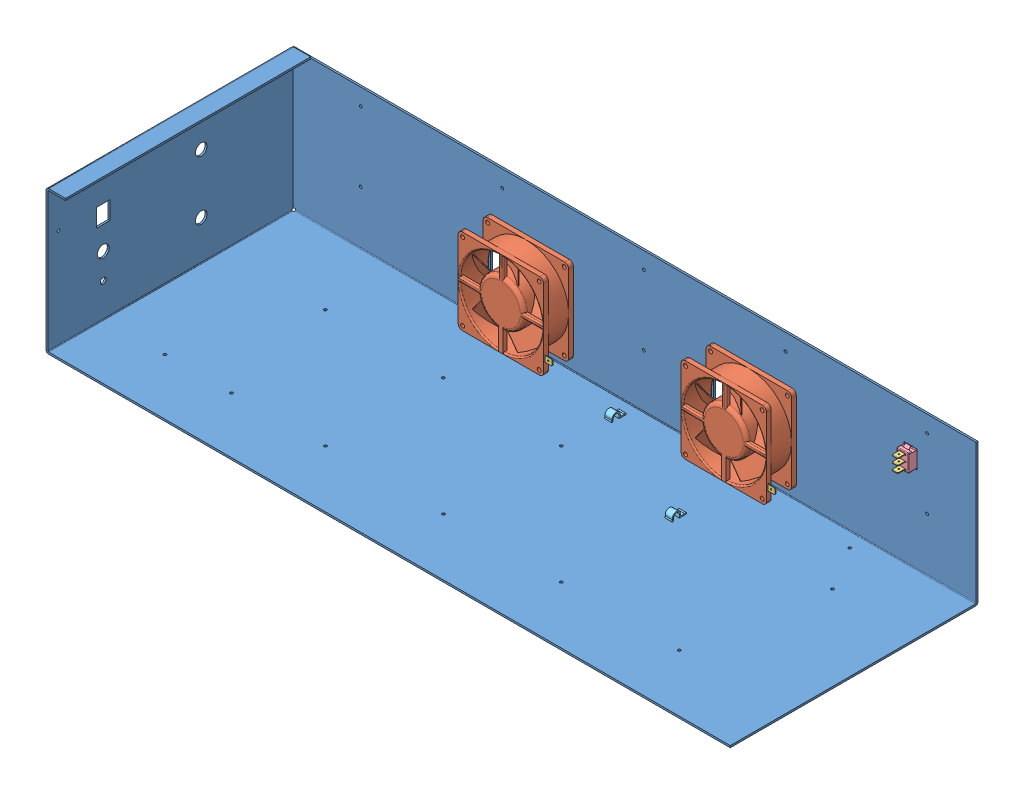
SolidWorks assembly Using_Slide_Clips.SLDASM, configuration Default (file format 13000). Lengths in mm.
Overall size (736.6 157.1 273.21).
14 component instances, 5 part files, 13 mates.
Components (placement in the parent):
- generic_enclosure-1: generic_enclosure.SLDPRT [Default] at origin size (736.6 154.43 266.72)
- FAN-1: FAN.SLDASM [Default] at (174.512 -3.3891 -442.2279) size (105.02 92.14 32.23)
  - FAN_w_CONN-1: FAN_w_CONN.SLDPRT [Default] at (-298.512 61.4211 233.7599) size (97.22 92.14 32.23)
  - Slide_Clip_Male-1: Slide_Clip_Male.SLDPRT [Default] at (-249.112 31.9883 237.1425) x (0 1 0) z (1 0 0) size (7.92 0.81 14.02)
- FAN-2: FAN.SLDASM [Default] at (414.512 -3.3891 -442.2279) size (105.02 92.14 32.23)
  - FAN_w_CONN-1: FAN_w_CONN.SLDPRT [Default] at (-298.512 61.4211 233.7599) size (97.22 92.14 32.23)
  - Slide_Clip_Male-1: Slide_Clip_Male.SLDPRT [Default] at (-249.112 31.9883 237.1425) x (0 1 0) z (1 0 0) size (7.92 0.81 14.02)
- SWITCH-2: SWITCH.SLDASM [Default] at (280.797 105.2322 -239.532) x (-1 0 0) z (0 0 -1) size (15.01 23.42 25.66)
  - SWITCH-3 PRONGS-1: SWITCH-3 PRONGS.SLDPRT [Default] at origin size (15.01 23.42 17.74)
  - Slide_Clip_Male-1: Slide_Clip_Male.SLDPRT [Default] at (-4.318 -6.556 -16.6842) x (-1 0 0) z (0 0 -1) size (7.92 0.81 14.02)
  - Slide_Clip_Male-2: Slide_Clip_Male.SLDPRT [Default] at (-4.318 0.4544 -16.6842) x (-1 0 0) z (0 0 -1) size (7.92 0.81 14.02)
  - Slide_Clip_Male-4: Slide_Clip_Male.SLDPRT [Default] at (-4.318 7.2108 -16.6842) x (-1 0 0) z (0 0 -1) size (7.92 0.81 14.02)
- richco_hurc-4-01-clip_3-3: richco_hurc-4-01-clip_3.SLDPRT [Default] at (112.268 5.207 -152.41) x (0 0 1) z (-1 0 0) size (15.75 12.32 7.64)
- richco_hurc-4-01-clip_3-5: richco_hurc-4-01-clip_3.SLDPRT [Default] at (-12.8623 5.207 -212.6259) x (0 0 1) z (-1 0 0) size (15.75 12.32 7.64)
Mates (geometry in assembly coordinates):
- Coincident1: coincident: plane of generic_enclosure-1 through (-381 152.4 -235.468) normal (0 0 1); plane of FAN-1/FAN_w_CONN-1 through (-170 104.032 -235.468) normal (0 0 -1)
- Concentric1: concentric: cylinder of generic_enclosure-1 through (-82.75 16.782 -237.5) axis (0 0 1) radius 2.15; cylinder of FAN-1/FAN_w_CONN-1 through (-82.75 16.782 -203.468) axis (0 0 -1) radius 2.15
- Concentric2: concentric: cylinder of generic_enclosure-1 through (-82.75 99.282 -237.5) axis (0 0 1) radius 2.15; cylinder of FAN-1/FAN_w_CONN-1 through (-82.75 99.282 -203.468) axis (0 0 -1) radius 2.15
- Coincident6: coincident: plane of generic_enclosure-1 through (-381 152.4 -235.468) normal (0 0 1); plane of FAN-2/FAN_w_CONN-1 through (70 104.032 -235.468) normal (0 0 -1)
- Concentric3: concentric: cylinder of generic_enclosure-1 through (157.25 16.782 -237.5) axis (0 0 1) radius 2.15; cylinder of FAN-2/FAN_w_CONN-1 through (157.25 16.782 -203.468) axis (0 0 -1) radius 2.15
- Concentric4: concentric: cylinder of generic_enclosure-1 through (157.25 99.282 -237.5) axis (0 0 1) radius 2.15; cylinder of FAN-2/FAN_w_CONN-1 through (157.25 99.282 -203.468) axis (0 0 -1) radius 2.15
- Coincident112: coincident: plane of generic_enclosure-1 through (-381 152.4 -237.5) normal (0 0 -1); plane of SWITCH-2/SWITCH-3 PRONGS-1 through (293.2557 94.8182 -237.5) normal (0 0 1)
- Coincident113: coincident: plane of generic_enclosure-1 through (277.876 114.3 -237.5) normal (0 -1 0); plane of SWITCH-2/SWITCH-3 PRONGS-1 through (293.2557 114.3 -235.0616) normal (0 1 0)
- Coincident114: coincident: plane of generic_enclosure-1 through (292.1 114.3 -237.5) normal (-1 0 0); plane of SWITCH-2/SWITCH-3 PRONGS-1 through (292.1 95.9612 -226.2478) normal (1 0 0)
- Concentric941: concentric: cylinder of generic_enclosure-1 through (112.268 -4.3105 -159.268) axis (0 1 0) radius 1.524; cylinder of richco_hurc-4-01-clip_3-3 through (112.268 2.032 -159.268) axis (0 -1 0) radius 1.524
- Coincident1171: coincident: plane of generic_enclosure-1 through (-381 2.032 237.5) normal (0 1 0); plane of richco_hurc-4-01-clip_3-3 through (108.458 2.032 -155.585) normal (0 -1 0)
- Concentric9521: concentric: cylinder of generic_enclosure-1 through (-12.8623 0 -219.4839) axis (0 1 0) radius 1.524; cylinder of richco_hurc-4-01-clip_3-5 through (-12.8623 2.032 -219.4839) axis (0 -1 0) radius 1.524
- Coincident11821: coincident: plane of generic_enclosure-1 through (-381 2.032 237.5) normal (0 1 0); plane of richco_hurc-4-01-clip_3-5 through (-16.6723 2.032 -215.8009) normal (0 -1 0)
